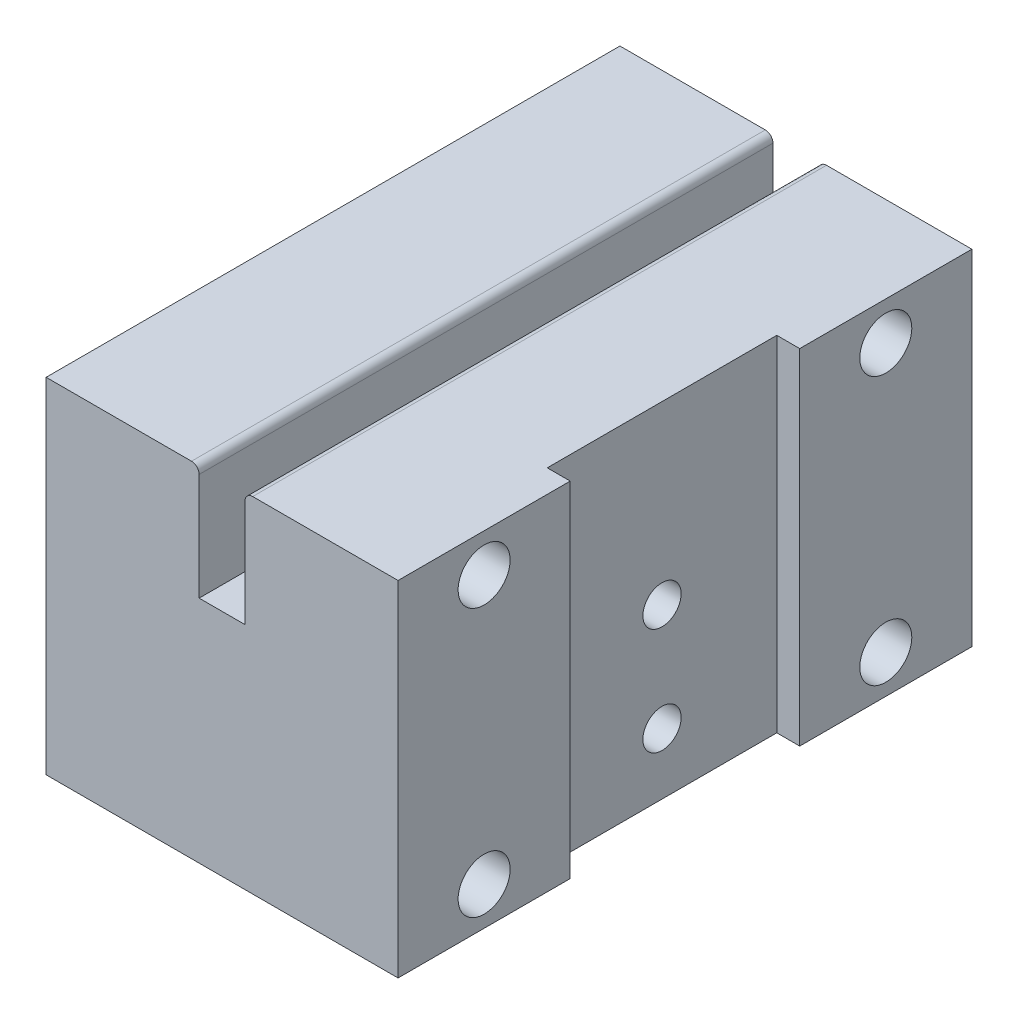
ISO-10303-21;
HEADER;
FILE_DESCRIPTION(('STEP AP214'),'2;1');
FILE_NAME('part.step','',(''),(''),'','','');
FILE_SCHEMA(('AUTOMOTIVE_DESIGN { 1 0 10303 214 1 1 1 1 }'));
ENDSEC;
DATA;
#1=APPLICATION_CONTEXT('core data for automotive mechanical design processes');
#2=APPLICATION_PROTOCOL_DEFINITION('international standard','automotive_design',2000,#1);
#3=PRODUCT_CONTEXT('',#1,'mechanical');
#4=PRODUCT('Part','Part','',(#3));
#5=PRODUCT_RELATED_PRODUCT_CATEGORY('part','',(#4));
#6=PRODUCT_DEFINITION_FORMATION('','',#4);
#7=PRODUCT_DEFINITION_CONTEXT('part definition',#1,'design');
#8=PRODUCT_DEFINITION('design','',#6,#7);
#9=PRODUCT_DEFINITION_SHAPE('','',#8);
#10=(LENGTH_UNIT() NAMED_UNIT(*) SI_UNIT(.MILLI.,.METRE.));
#11=(NAMED_UNIT(*) PLANE_ANGLE_UNIT() SI_UNIT($,.RADIAN.));
#12=(NAMED_UNIT(*) SI_UNIT($,.STERADIAN.) SOLID_ANGLE_UNIT());
#13=UNCERTAINTY_MEASURE_WITH_UNIT(LENGTH_MEASURE(1.E-05),#10,'distance_accuracy_value','');
#14=(GEOMETRIC_REPRESENTATION_CONTEXT(3) GLOBAL_UNCERTAINTY_ASSIGNED_CONTEXT((#13)) GLOBAL_UNIT_ASSIGNED_CONTEXT((#10,
#11,#12)) REPRESENTATION_CONTEXT('',''));
#15=CARTESIAN_POINT('',(0.,0.,0.));
#16=DIRECTION('',(0.,0.,1.));
#17=DIRECTION('',(1.,0.,0.));
#18=AXIS2_PLACEMENT_3D('',#15,#16,#17);
#19=CARTESIAN_POINT('',(23.,22.5,37.5));
#20=DIRECTION('',(-1.,0.,0.));
#21=DIRECTION('',(0.,-1.,0.));
#22=AXIS2_PLACEMENT_3D('',#19,#20,#21);
#23=PLANE('',#22);
#24=CARTESIAN_POINT('',(23.,-17.5,-26.2500000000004));
#25=DIRECTION('',(1.,0.,0.));
#26=DIRECTION('',(0.,1.,0.));
#27=AXIS2_PLACEMENT_3D('',#24,#25,#26);
#28=CIRCLE('',#27,3.4);
#29=CARTESIAN_POINT('',(23.,-14.1,-26.2500000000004));
#30=VERTEX_POINT('',#29);
#31=EDGE_CURVE('E627',#30,#30,#28,.T.);
#32=ORIENTED_EDGE('',*,*,#31,.F.);
#33=EDGE_LOOP('',(#32));
#34=FACE_BOUND('',#33,.T.);
#35=CARTESIAN_POINT('',(23.,17.5,-26.25));
#36=DIRECTION('',(1.,0.,0.));
#37=DIRECTION('',(0.,1.,0.));
#38=AXIS2_PLACEMENT_3D('',#35,#36,#37);
#39=CIRCLE('',#38,3.4);
#40=CARTESIAN_POINT('',(23.,20.9,-26.25));
#41=VERTEX_POINT('',#40);
#42=EDGE_CURVE('E373',#41,#41,#39,.T.);
#43=ORIENTED_EDGE('',*,*,#42,.F.);
#44=EDGE_LOOP('',(#43));
#45=FACE_BOUND('',#44,.T.);
#46=DIRECTION('',(0.,0.,-1.));
#47=VECTOR('',#46,1.);
#48=CARTESIAN_POINT('',(23.,22.5,37.5));
#49=LINE('',#48,#47);
#50=CARTESIAN_POINT('',(23.,22.5,-15.));
#51=VERTEX_POINT('',#50);
#52=CARTESIAN_POINT('',(23.,22.5,-37.5));
#53=VERTEX_POINT('',#52);
#54=EDGE_CURVE('E247',#51,#53,#49,.T.);
#55=ORIENTED_EDGE('',*,*,#54,.F.);
#56=DIRECTION('',(0.,1.,0.));
#57=VECTOR('',#56,1.);
#58=CARTESIAN_POINT('',(23.,22.5,-15.));
#59=LINE('',#58,#57);
#60=CARTESIAN_POINT('',(23.,-22.5,-15.));
#61=VERTEX_POINT('',#60);
#62=EDGE_CURVE('E158',#61,#51,#59,.T.);
#63=ORIENTED_EDGE('',*,*,#62,.F.);
#64=DIRECTION('',(0.,0.,-1.));
#65=VECTOR('',#64,1.);
#66=CARTESIAN_POINT('',(23.,-22.5,37.5));
#67=LINE('',#66,#65);
#68=CARTESIAN_POINT('',(23.,-22.5,-37.5));
#69=VERTEX_POINT('',#68);
#70=EDGE_CURVE('E220',#61,#69,#67,.T.);
#71=ORIENTED_EDGE('',*,*,#70,.T.);
#72=DIRECTION('',(0.,1.,0.));
#73=VECTOR('',#72,1.);
#74=CARTESIAN_POINT('',(23.,22.5,-37.5));
#75=LINE('',#74,#73);
#76=EDGE_CURVE('E203',#69,#53,#75,.T.);
#77=ORIENTED_EDGE('',*,*,#76,.T.);
#78=EDGE_LOOP('',(#55,#63,#71,#77));
#79=FACE_BOUND('',#78,.T.);
#80=ADVANCED_FACE('F39',(#34,#45,#79),#23,.F.);
#81=CARTESIAN_POINT('',(-23.,22.5,37.5));
#82=DIRECTION('',(0.,-1.,0.));
#83=DIRECTION('',(0.,0.,-1.));
#84=AXIS2_PLACEMENT_3D('',#81,#82,#83);
#85=PLANE('',#84);
#86=DIRECTION('',(-1.,0.,0.));
#87=VECTOR('',#86,1.);
#88=CARTESIAN_POINT('',(-23.,22.5,37.5));
#89=LINE('',#88,#87);
#90=CARTESIAN_POINT('',(-4.,22.5,37.5));
#91=VERTEX_POINT('',#90);
#92=CARTESIAN_POINT('',(-23.,22.5,37.5));
#93=VERTEX_POINT('',#92);
#94=EDGE_CURVE('E208',#91,#93,#89,.T.);
#95=ORIENTED_EDGE('',*,*,#94,.F.);
#96=DIRECTION('',(0.,0.,1.));
#97=VECTOR('',#96,1.);
#98=CARTESIAN_POINT('',(-4.,22.5,37.5));
#99=LINE('',#98,#97);
#100=CARTESIAN_POINT('',(-4.,22.5,-37.5));
#101=VERTEX_POINT('',#100);
#102=EDGE_CURVE('E11',#91,#101,#99,.F.);
#103=ORIENTED_EDGE('',*,*,#102,.T.);
#104=DIRECTION('',(-1.,0.,0.));
#105=VECTOR('',#104,1.);
#106=CARTESIAN_POINT('',(-23.,22.5,-37.5));
#107=LINE('',#106,#105);
#108=CARTESIAN_POINT('',(-23.,22.5,-37.5));
#109=VERTEX_POINT('',#108);
#110=EDGE_CURVE('E224',#101,#109,#107,.T.);
#111=ORIENTED_EDGE('',*,*,#110,.T.);
#112=DIRECTION('',(0.,0.,-1.));
#113=VECTOR('',#112,1.);
#114=CARTESIAN_POINT('',(-23.,22.5,37.5));
#115=LINE('',#114,#113);
#116=EDGE_CURVE('E243',#93,#109,#115,.T.);
#117=ORIENTED_EDGE('',*,*,#116,.F.);
#118=EDGE_LOOP('',(#95,#103,#111,#117));
#119=FACE_BOUND('',#118,.T.);
#120=ADVANCED_FACE('F328',(#119),#85,.F.);
#121=CARTESIAN_POINT('',(23.,-17.5,26.2499999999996));
#122=DIRECTION('',(1.,0.,0.));
#123=DIRECTION('',(0.,1.,0.));
#124=AXIS2_PLACEMENT_3D('',#121,#122,#123);
#125=CIRCLE('',#124,3.4);
#126=CARTESIAN_POINT('',(23.,-14.1,26.2499999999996));
#127=VERTEX_POINT('',#126);
#128=EDGE_CURVE('E358',#127,#127,#125,.T.);
#129=ORIENTED_EDGE('',*,*,#128,.F.);
#130=EDGE_LOOP('',(#129));
#131=FACE_BOUND('',#130,.T.);
#132=CARTESIAN_POINT('',(23.,17.5,26.25));
#133=DIRECTION('',(1.,0.,0.));
#134=DIRECTION('',(0.,1.,0.));
#135=AXIS2_PLACEMENT_3D('',#132,#133,#134);
#136=CIRCLE('',#135,3.4);
#137=CARTESIAN_POINT('',(23.,20.9,26.25));
#138=VERTEX_POINT('',#137);
#139=EDGE_CURVE('E361',#138,#138,#136,.T.);
#140=ORIENTED_EDGE('',*,*,#139,.F.);
#141=EDGE_LOOP('',(#140));
#142=FACE_BOUND('',#141,.T.);
#143=CARTESIAN_POINT('',(23.,-22.5,37.5));
#144=VERTEX_POINT('',#143);
#145=CARTESIAN_POINT('',(23.,-22.5,15.));
#146=VERTEX_POINT('',#145);
#147=EDGE_CURVE('E235',#144,#146,#67,.T.);
#148=ORIENTED_EDGE('',*,*,#147,.T.);
#149=DIRECTION('',(0.,-1.,0.));
#150=VECTOR('',#149,1.);
#151=CARTESIAN_POINT('',(23.,22.5,15.));
#152=LINE('',#151,#150);
#153=CARTESIAN_POINT('',(23.,22.5,15.));
#154=VERTEX_POINT('',#153);
#155=EDGE_CURVE('E298',#154,#146,#152,.T.);
#156=ORIENTED_EDGE('',*,*,#155,.F.);
#157=CARTESIAN_POINT('',(23.,22.5,37.5));
#158=VERTEX_POINT('',#157);
#159=EDGE_CURVE('E163',#158,#154,#49,.T.);
#160=ORIENTED_EDGE('',*,*,#159,.F.);
#161=DIRECTION('',(0.,1.,0.));
#162=VECTOR('',#161,1.);
#163=CARTESIAN_POINT('',(23.,22.5,37.5));
#164=LINE('',#163,#162);
#165=EDGE_CURVE('E204',#144,#158,#164,.T.);
#166=ORIENTED_EDGE('',*,*,#165,.F.);
#167=EDGE_LOOP('',(#148,#156,#160,#166));
#168=FACE_BOUND('',#167,.T.);
#169=ADVANCED_FACE('F297',(#131,#142,#168),#23,.F.);
#170=DIRECTION('',(0.,0.,1.));
#171=VECTOR('',#170,1.);
#172=CARTESIAN_POINT('',(20.,22.5,15.));
#173=LINE('',#172,#171);
#174=CARTESIAN_POINT('',(20.,22.5,-15.));
#175=VERTEX_POINT('',#174);
#176=CARTESIAN_POINT('',(20.,22.5,15.));
#177=VERTEX_POINT('',#176);
#178=EDGE_CURVE('E148',#175,#177,#173,.T.);
#179=ORIENTED_EDGE('',*,*,#178,.F.);
#180=DIRECTION('',(1.,0.,0.));
#181=VECTOR('',#180,1.);
#182=CARTESIAN_POINT('',(20.,22.5,-15.));
#183=LINE('',#182,#181);
#184=EDGE_CURVE('E177',#175,#51,#183,.T.);
#185=ORIENTED_EDGE('',*,*,#184,.T.);
#186=ORIENTED_EDGE('',*,*,#54,.T.);
#187=CARTESIAN_POINT('',(4.,22.5,-37.5));
#188=VERTEX_POINT('',#187);
#189=EDGE_CURVE('E225',#53,#188,#107,.T.);
#190=ORIENTED_EDGE('',*,*,#189,.T.);
#191=DIRECTION('',(0.,0.,1.));
#192=VECTOR('',#191,1.);
#193=CARTESIAN_POINT('',(4.,22.5,37.5));
#194=LINE('',#193,#192);
#195=CARTESIAN_POINT('',(4.,22.5,37.5));
#196=VERTEX_POINT('',#195);
#197=EDGE_CURVE('E250',#188,#196,#194,.T.);
#198=ORIENTED_EDGE('',*,*,#197,.T.);
#199=EDGE_CURVE('E210',#158,#196,#89,.T.);
#200=ORIENTED_EDGE('',*,*,#199,.F.);
#201=ORIENTED_EDGE('',*,*,#159,.T.);
#202=DIRECTION('',(1.,0.,0.));
#203=VECTOR('',#202,1.);
#204=CARTESIAN_POINT('',(20.,22.5,15.));
#205=LINE('',#204,#203);
#206=EDGE_CURVE('E141',#177,#154,#205,.T.);
#207=ORIENTED_EDGE('',*,*,#206,.F.);
#208=EDGE_LOOP('',(#179,#185,#186,#190,#198,#200,#201,#207));
#209=FACE_BOUND('',#208,.T.);
#210=ADVANCED_FACE('F161',(#209),#85,.F.);
#211=CARTESIAN_POINT('',(-23.,22.5,37.5));
#212=DIRECTION('',(1.,0.,0.));
#213=DIRECTION('',(0.,1.,0.));
#214=AXIS2_PLACEMENT_3D('',#211,#212,#213);
#215=PLANE('',#214);
#216=DIRECTION('',(0.,-1.,0.));
#217=VECTOR('',#216,1.);
#218=CARTESIAN_POINT('',(-23.,22.5,-37.5));
#219=LINE('',#218,#217);
#220=CARTESIAN_POINT('',(-23.,-22.5,-37.5));
#221=VERTEX_POINT('',#220);
#222=EDGE_CURVE('E229',#109,#221,#219,.T.);
#223=ORIENTED_EDGE('',*,*,#222,.T.);
#224=DIRECTION('',(0.,0.,-1.));
#225=VECTOR('',#224,1.);
#226=CARTESIAN_POINT('',(-23.,-22.5,37.5));
#227=LINE('',#226,#225);
#228=CARTESIAN_POINT('',(-23.,-22.5,37.5));
#229=VERTEX_POINT('',#228);
#230=EDGE_CURVE('E239',#229,#221,#227,.T.);
#231=ORIENTED_EDGE('',*,*,#230,.F.);
#232=DIRECTION('',(0.,-1.,0.));
#233=VECTOR('',#232,1.);
#234=CARTESIAN_POINT('',(-23.,22.5,37.5));
#235=LINE('',#234,#233);
#236=EDGE_CURVE('E214',#93,#229,#235,.T.);
#237=ORIENTED_EDGE('',*,*,#236,.F.);
#238=ORIENTED_EDGE('',*,*,#116,.T.);
#239=EDGE_LOOP('',(#223,#231,#237,#238));
#240=FACE_BOUND('',#239,.T.);
#241=ADVANCED_FACE('F333',(#240),#215,.F.);
#242=CARTESIAN_POINT('',(-23.,-22.5,37.5));
#243=DIRECTION('',(0.,1.,0.));
#244=DIRECTION('',(0.,0.,1.));
#245=AXIS2_PLACEMENT_3D('',#242,#243,#244);
#246=PLANE('',#245);
#247=ORIENTED_EDGE('',*,*,#70,.F.);
#248=DIRECTION('',(1.,0.,0.));
#249=VECTOR('',#248,1.);
#250=CARTESIAN_POINT('',(20.,-22.5,-15.));
#251=LINE('',#250,#249);
#252=CARTESIAN_POINT('',(20.,-22.5,-15.));
#253=VERTEX_POINT('',#252);
#254=EDGE_CURVE('E168',#253,#61,#251,.T.);
#255=ORIENTED_EDGE('',*,*,#254,.F.);
#256=DIRECTION('',(0.,0.,-1.));
#257=VECTOR('',#256,1.);
#258=CARTESIAN_POINT('',(20.,-22.5,15.));
#259=LINE('',#258,#257);
#260=CARTESIAN_POINT('',(20.,-22.5,15.));
#261=VERTEX_POINT('',#260);
#262=EDGE_CURVE('E147',#261,#253,#259,.T.);
#263=ORIENTED_EDGE('',*,*,#262,.F.);
#264=DIRECTION('',(1.,0.,0.));
#265=VECTOR('',#264,1.);
#266=CARTESIAN_POINT('',(20.,-22.5,15.));
#267=LINE('',#266,#265);
#268=EDGE_CURVE('E144',#261,#146,#267,.T.);
#269=ORIENTED_EDGE('',*,*,#268,.T.);
#270=ORIENTED_EDGE('',*,*,#147,.F.);
#271=DIRECTION('',(1.,0.,0.));
#272=VECTOR('',#271,1.);
#273=CARTESIAN_POINT('',(-23.,-22.5,37.5));
#274=LINE('',#273,#272);
#275=EDGE_CURVE('E217',#229,#144,#274,.T.);
#276=ORIENTED_EDGE('',*,*,#275,.F.);
#277=ORIENTED_EDGE('',*,*,#230,.T.);
#278=DIRECTION('',(1.,0.,0.));
#279=VECTOR('',#278,1.);
#280=CARTESIAN_POINT('',(-23.,-22.5,-37.5));
#281=LINE('',#280,#279);
#282=EDGE_CURVE('E209',#221,#69,#281,.T.);
#283=ORIENTED_EDGE('',*,*,#282,.T.);
#284=EDGE_LOOP('',(#247,#255,#263,#269,#270,#276,#277,#283));
#285=FACE_BOUND('',#284,.T.);
#286=ADVANCED_FACE('F320',(#285),#246,.F.);
#287=CARTESIAN_POINT('',(0.,0.,37.5));
#288=DIRECTION('',(0.,0.,1.));
#289=DIRECTION('',(1.,0.,0.));
#290=AXIS2_PLACEMENT_3D('',#287,#288,#289);
#291=PLANE('',#290);
#292=ORIENTED_EDGE('',*,*,#199,.T.);
#293=CARTESIAN_POINT('',(4.,21.5,37.5));
#294=DIRECTION('',(0.,0.,1.));
#295=DIRECTION('',(1.,0.,0.));
#296=AXIS2_PLACEMENT_3D('',#293,#294,#295);
#297=CIRCLE('',#296,1.);
#298=CARTESIAN_POINT('',(3.,21.5,37.5));
#299=VERTEX_POINT('',#298);
#300=EDGE_CURVE('E257',#196,#299,#297,.T.);
#301=ORIENTED_EDGE('',*,*,#300,.T.);
#302=DIRECTION('',(0.,1.,0.));
#303=VECTOR('',#302,1.);
#304=CARTESIAN_POINT('',(3.,0.,37.5));
#305=LINE('',#304,#303);
#306=CARTESIAN_POINT('',(3.,7.5,37.5));
#307=VERTEX_POINT('',#306);
#308=EDGE_CURVE('E196',#307,#299,#305,.T.);
#309=ORIENTED_EDGE('',*,*,#308,.F.);
#310=DIRECTION('',(1.,0.,0.));
#311=VECTOR('',#310,1.);
#312=CARTESIAN_POINT('',(0.,7.5,37.5));
#313=LINE('',#312,#311);
#314=CARTESIAN_POINT('',(-3.,7.5,37.5));
#315=VERTEX_POINT('',#314);
#316=EDGE_CURVE('E190',#315,#307,#313,.T.);
#317=ORIENTED_EDGE('',*,*,#316,.F.);
#318=DIRECTION('',(0.,-1.,0.));
#319=VECTOR('',#318,1.);
#320=CARTESIAN_POINT('',(-3.,0.,37.5));
#321=LINE('',#320,#319);
#322=CARTESIAN_POINT('',(-3.,21.5,37.5));
#323=VERTEX_POINT('',#322);
#324=EDGE_CURVE('E200',#323,#315,#321,.T.);
#325=ORIENTED_EDGE('',*,*,#324,.F.);
#326=CARTESIAN_POINT('',(-4.,21.5,37.5));
#327=DIRECTION('',(0.,0.,1.));
#328=DIRECTION('',(1.,0.,0.));
#329=AXIS2_PLACEMENT_3D('',#326,#327,#328);
#330=CIRCLE('',#329,1.);
#331=EDGE_CURVE('E254',#323,#91,#330,.T.);
#332=ORIENTED_EDGE('',*,*,#331,.T.);
#333=ORIENTED_EDGE('',*,*,#94,.T.);
#334=ORIENTED_EDGE('',*,*,#236,.T.);
#335=ORIENTED_EDGE('',*,*,#275,.T.);
#336=ORIENTED_EDGE('',*,*,#165,.T.);
#337=EDGE_LOOP('',(#292,#301,#309,#317,#325,#332,#333,#334,#335,#336));
#338=FACE_BOUND('',#337,.T.);
#339=ADVANCED_FACE('F277',(#338),#291,.T.);
#340=CARTESIAN_POINT('',(0.,0.,-37.5));
#341=DIRECTION('',(0.,0.,1.));
#342=DIRECTION('',(1.,0.,0.));
#343=AXIS2_PLACEMENT_3D('',#340,#341,#342);
#344=PLANE('',#343);
#345=DIRECTION('',(0.,1.,0.));
#346=VECTOR('',#345,1.);
#347=CARTESIAN_POINT('',(3.,22.5,-37.5));
#348=LINE('',#347,#346);
#349=CARTESIAN_POINT('',(3.,7.5,-37.5));
#350=VERTEX_POINT('',#349);
#351=CARTESIAN_POINT('',(3.,21.5,-37.5));
#352=VERTEX_POINT('',#351);
#353=EDGE_CURVE('E181',#350,#352,#348,.T.);
#354=ORIENTED_EDGE('',*,*,#353,.T.);
#355=CARTESIAN_POINT('',(4.,21.5,-37.5));
#356=DIRECTION('',(0.,0.,1.));
#357=DIRECTION('',(1.,0.,0.));
#358=AXIS2_PLACEMENT_3D('',#355,#356,#357);
#359=CIRCLE('',#358,1.);
#360=EDGE_CURVE('E265',#352,#188,#359,.F.);
#361=ORIENTED_EDGE('',*,*,#360,.T.);
#362=ORIENTED_EDGE('',*,*,#189,.F.);
#363=ORIENTED_EDGE('',*,*,#76,.F.);
#364=ORIENTED_EDGE('',*,*,#282,.F.);
#365=ORIENTED_EDGE('',*,*,#222,.F.);
#366=ORIENTED_EDGE('',*,*,#110,.F.);
#367=CARTESIAN_POINT('',(-4.,21.5,-37.5));
#368=DIRECTION('',(0.,0.,1.));
#369=DIRECTION('',(1.,0.,0.));
#370=AXIS2_PLACEMENT_3D('',#367,#368,#369);
#371=CIRCLE('',#370,1.);
#372=CARTESIAN_POINT('',(-3.,21.5,-37.5));
#373=VERTEX_POINT('',#372);
#374=EDGE_CURVE('E63',#101,#373,#371,.F.);
#375=ORIENTED_EDGE('',*,*,#374,.T.);
#376=DIRECTION('',(0.,-1.,0.));
#377=VECTOR('',#376,1.);
#378=CARTESIAN_POINT('',(-3.,22.5,-37.5));
#379=LINE('',#378,#377);
#380=CARTESIAN_POINT('',(-3.,7.5,-37.5));
#381=VERTEX_POINT('',#380);
#382=EDGE_CURVE('E173',#373,#381,#379,.T.);
#383=ORIENTED_EDGE('',*,*,#382,.T.);
#384=DIRECTION('',(1.,0.,0.));
#385=VECTOR('',#384,1.);
#386=CARTESIAN_POINT('',(-3.,7.5,-37.5));
#387=LINE('',#386,#385);
#388=EDGE_CURVE('E176',#381,#350,#387,.T.);
#389=ORIENTED_EDGE('',*,*,#388,.T.);
#390=EDGE_LOOP('',(#354,#361,#362,#363,#364,#365,#366,#375,#383,#389));
#391=FACE_BOUND('',#390,.T.);
#392=ADVANCED_FACE('F288',(#391),#344,.F.);
#393=CARTESIAN_POINT('',(-3.,22.5,-37.5));
#394=DIRECTION('',(-1.,0.,0.));
#395=DIRECTION('',(0.,-1.,0.));
#396=AXIS2_PLACEMENT_3D('',#393,#394,#395);
#397=PLANE('',#396);
#398=ORIENTED_EDGE('',*,*,#382,.F.);
#399=DIRECTION('',(0.,0.,1.));
#400=VECTOR('',#399,1.);
#401=CARTESIAN_POINT('',(-3.,21.5,-37.5));
#402=LINE('',#401,#400);
#403=EDGE_CURVE('E48',#373,#323,#402,.T.);
#404=ORIENTED_EDGE('',*,*,#403,.T.);
#405=ORIENTED_EDGE('',*,*,#324,.T.);
#406=DIRECTION('',(0.,0.,1.));
#407=VECTOR('',#406,1.);
#408=CARTESIAN_POINT('',(-3.,7.5,-37.5));
#409=LINE('',#408,#407);
#410=EDGE_CURVE('E185',#381,#315,#409,.T.);
#411=ORIENTED_EDGE('',*,*,#410,.F.);
#412=EDGE_LOOP('',(#398,#404,#405,#411));
#413=FACE_BOUND('',#412,.T.);
#414=ADVANCED_FACE('F272',(#413),#397,.F.);
#415=CARTESIAN_POINT('',(3.,22.5,-37.5));
#416=DIRECTION('',(1.,0.,0.));
#417=DIRECTION('',(0.,1.,0.));
#418=AXIS2_PLACEMENT_3D('',#415,#416,#417);
#419=PLANE('',#418);
#420=ORIENTED_EDGE('',*,*,#308,.T.);
#421=DIRECTION('',(0.,0.,1.));
#422=VECTOR('',#421,1.);
#423=CARTESIAN_POINT('',(3.,21.5,-37.5));
#424=LINE('',#423,#422);
#425=EDGE_CURVE('E260',#299,#352,#424,.F.);
#426=ORIENTED_EDGE('',*,*,#425,.T.);
#427=ORIENTED_EDGE('',*,*,#353,.F.);
#428=DIRECTION('',(0.,0.,1.));
#429=VECTOR('',#428,1.);
#430=CARTESIAN_POINT('',(3.,7.5,-37.5));
#431=LINE('',#430,#429);
#432=EDGE_CURVE('E186',#350,#307,#431,.T.);
#433=ORIENTED_EDGE('',*,*,#432,.T.);
#434=EDGE_LOOP('',(#420,#426,#427,#433));
#435=FACE_BOUND('',#434,.T.);
#436=ADVANCED_FACE('F285',(#435),#419,.F.);
#437=CARTESIAN_POINT('',(-3.,7.5,-37.5));
#438=DIRECTION('',(0.,-1.,0.));
#439=DIRECTION('',(0.,0.,-1.));
#440=AXIS2_PLACEMENT_3D('',#437,#438,#439);
#441=PLANE('',#440);
#442=ORIENTED_EDGE('',*,*,#316,.T.);
#443=ORIENTED_EDGE('',*,*,#432,.F.);
#444=ORIENTED_EDGE('',*,*,#388,.F.);
#445=ORIENTED_EDGE('',*,*,#410,.T.);
#446=EDGE_LOOP('',(#442,#443,#444,#445));
#447=FACE_BOUND('',#446,.T.);
#448=ADVANCED_FACE('F282',(#447),#441,.F.);
#449=CARTESIAN_POINT('',(4.,21.5,37.5));
#450=DIRECTION('',(0.,0.,1.));
#451=DIRECTION('',(1.,0.,0.));
#452=AXIS2_PLACEMENT_3D('',#449,#450,#451);
#453=CYLINDRICAL_SURFACE('',#452,1.);
#454=ORIENTED_EDGE('',*,*,#360,.F.);
#455=ORIENTED_EDGE('',*,*,#425,.F.);
#456=ORIENTED_EDGE('',*,*,#300,.F.);
#457=ORIENTED_EDGE('',*,*,#197,.F.);
#458=EDGE_LOOP('',(#454,#455,#456,#457));
#459=FACE_BOUND('',#458,.T.);
#460=ADVANCED_FACE('F292',(#459),#453,.T.);
#461=CARTESIAN_POINT('',(-4.,21.5,-37.5));
#462=DIRECTION('',(0.,0.,1.));
#463=DIRECTION('',(1.,0.,0.));
#464=AXIS2_PLACEMENT_3D('',#461,#462,#463);
#465=CYLINDRICAL_SURFACE('',#464,1.);
#466=ORIENTED_EDGE('',*,*,#374,.F.);
#467=ORIENTED_EDGE('',*,*,#102,.F.);
#468=ORIENTED_EDGE('',*,*,#331,.F.);
#469=ORIENTED_EDGE('',*,*,#403,.F.);
#470=EDGE_LOOP('',(#466,#467,#468,#469));
#471=FACE_BOUND('',#470,.T.);
#472=ADVANCED_FACE('F41',(#471),#465,.T.);
#473=CARTESIAN_POINT('',(20.,22.5,-15.));
#474=DIRECTION('',(0.,0.,-1.));
#475=DIRECTION('',(0.,1.,0.));
#476=AXIS2_PLACEMENT_3D('',#473,#474,#475);
#477=PLANE('',#476);
#478=ORIENTED_EDGE('',*,*,#62,.T.);
#479=ORIENTED_EDGE('',*,*,#184,.F.);
#480=DIRECTION('',(0.,1.,0.));
#481=VECTOR('',#480,1.);
#482=CARTESIAN_POINT('',(20.,22.5,-15.));
#483=LINE('',#482,#481);
#484=EDGE_CURVE('E154',#253,#175,#483,.T.);
#485=ORIENTED_EDGE('',*,*,#484,.F.);
#486=ORIENTED_EDGE('',*,*,#254,.T.);
#487=EDGE_LOOP('',(#478,#479,#485,#486));
#488=FACE_BOUND('',#487,.T.);
#489=ADVANCED_FACE('F315',(#488),#477,.F.);
#490=CARTESIAN_POINT('',(20.,22.5,15.));
#491=DIRECTION('',(0.,0.,1.));
#492=DIRECTION('',(0.,-1.,0.));
#493=AXIS2_PLACEMENT_3D('',#490,#491,#492);
#494=PLANE('',#493);
#495=ORIENTED_EDGE('',*,*,#155,.T.);
#496=ORIENTED_EDGE('',*,*,#268,.F.);
#497=DIRECTION('',(0.,-1.,0.));
#498=VECTOR('',#497,1.);
#499=CARTESIAN_POINT('',(20.,22.5,15.));
#500=LINE('',#499,#498);
#501=EDGE_CURVE('E55',#177,#261,#500,.T.);
#502=ORIENTED_EDGE('',*,*,#501,.F.);
#503=ORIENTED_EDGE('',*,*,#206,.T.);
#504=EDGE_LOOP('',(#495,#496,#502,#503));
#505=FACE_BOUND('',#504,.T.);
#506=ADVANCED_FACE('F139',(#505),#494,.F.);
#507=CARTESIAN_POINT('',(20.,0.,0.));
#508=DIRECTION('',(-1.,0.,0.));
#509=DIRECTION('',(0.,-1.,0.));
#510=AXIS2_PLACEMENT_3D('',#507,#508,#509);
#511=PLANE('',#510);
#512=CARTESIAN_POINT('',(20.,-0.499999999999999,0.));
#513=DIRECTION('',(1.,0.,0.));
#514=DIRECTION('',(0.,1.,0.));
#515=AXIS2_PLACEMENT_3D('',#512,#513,#514);
#516=CIRCLE('',#515,2.5);
#517=CARTESIAN_POINT('',(20.,2.,0.));
#518=VERTEX_POINT('',#517);
#519=EDGE_CURVE('E306',#518,#518,#516,.T.);
#520=ORIENTED_EDGE('',*,*,#519,.F.);
#521=EDGE_LOOP('',(#520));
#522=FACE_BOUND('',#521,.T.);
#523=CARTESIAN_POINT('',(20.,-14.5,0.));
#524=DIRECTION('',(1.,0.,0.));
#525=DIRECTION('',(0.,1.,0.));
#526=AXIS2_PLACEMENT_3D('',#523,#524,#525);
#527=CIRCLE('',#526,2.5);
#528=CARTESIAN_POINT('',(20.,-12.,0.));
#529=VERTEX_POINT('',#528);
#530=EDGE_CURVE('E370',#529,#529,#527,.T.);
#531=ORIENTED_EDGE('',*,*,#530,.F.);
#532=EDGE_LOOP('',(#531));
#533=FACE_BOUND('',#532,.T.);
#534=ORIENTED_EDGE('',*,*,#178,.T.);
#535=ORIENTED_EDGE('',*,*,#501,.T.);
#536=ORIENTED_EDGE('',*,*,#262,.T.);
#537=ORIENTED_EDGE('',*,*,#484,.T.);
#538=EDGE_LOOP('',(#534,#535,#536,#537));
#539=FACE_BOUND('',#538,.T.);
#540=ADVANCED_FACE('F152',(#522,#533,#539),#511,.F.);
#541=CARTESIAN_POINT('',(0.,-14.5,0.));
#542=DIRECTION('',(1.,0.,0.));
#543=DIRECTION('',(0.,1.,0.));
#544=AXIS2_PLACEMENT_3D('',#541,#542,#543);
#545=CYLINDRICAL_SURFACE('',#544,2.5);
#546=CARTESIAN_POINT('',(0.,-14.5,0.));
#547=DIRECTION('',(1.,0.,0.));
#548=DIRECTION('',(0.,1.,0.));
#549=AXIS2_PLACEMENT_3D('',#546,#547,#548);
#550=CIRCLE('',#549,2.5);
#551=CARTESIAN_POINT('',(0.,-12.,0.));
#552=VERTEX_POINT('',#551);
#553=EDGE_CURVE('E380',#552,#552,#550,.T.);
#554=ORIENTED_EDGE('',*,*,#553,.F.);
#555=EDGE_LOOP('',(#554));
#556=FACE_BOUND('',#555,.T.);
#557=ORIENTED_EDGE('',*,*,#530,.T.);
#558=EDGE_LOOP('',(#557));
#559=FACE_BOUND('',#558,.T.);
#560=ADVANCED_FACE('F389',(#556,#559),#545,.F.);
#561=CARTESIAN_POINT('',(0.,-14.5,0.));
#562=DIRECTION('',(1.,0.,0.));
#563=DIRECTION('',(0.,1.,0.));
#564=AXIS2_PLACEMENT_3D('',#561,#562,#563);
#565=PLANE('',#564);
#566=ORIENTED_EDGE('',*,*,#553,.T.);
#567=EDGE_LOOP('',(#566));
#568=FACE_BOUND('',#567,.T.);
#569=ADVANCED_FACE('F398',(#568),#565,.T.);
#570=CARTESIAN_POINT('',(0.,-0.500000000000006,0.));
#571=DIRECTION('',(1.,0.,0.));
#572=DIRECTION('',(0.,1.,0.));
#573=AXIS2_PLACEMENT_3D('',#570,#571,#572);
#574=CYLINDRICAL_SURFACE('',#573,2.5);
#575=CARTESIAN_POINT('',(0.,-0.500000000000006,0.));
#576=DIRECTION('',(1.,0.,0.));
#577=DIRECTION('',(0.,1.,0.));
#578=AXIS2_PLACEMENT_3D('',#575,#576,#577);
#579=CIRCLE('',#578,2.5);
#580=CARTESIAN_POINT('',(0.,1.99999999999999,0.));
#581=VERTEX_POINT('',#580);
#582=EDGE_CURVE('E300',#581,#581,#579,.T.);
#583=ORIENTED_EDGE('',*,*,#582,.F.);
#584=EDGE_LOOP('',(#583));
#585=FACE_BOUND('',#584,.T.);
#586=ORIENTED_EDGE('',*,*,#519,.T.);
#587=EDGE_LOOP('',(#586));
#588=FACE_BOUND('',#587,.T.);
#589=ADVANCED_FACE('F576',(#585,#588),#574,.F.);
#590=CARTESIAN_POINT('',(0.,-0.500000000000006,0.));
#591=DIRECTION('',(1.,0.,0.));
#592=DIRECTION('',(0.,1.,0.));
#593=AXIS2_PLACEMENT_3D('',#590,#591,#592);
#594=PLANE('',#593);
#595=ORIENTED_EDGE('',*,*,#582,.T.);
#596=EDGE_LOOP('',(#595));
#597=FACE_BOUND('',#596,.T.);
#598=ADVANCED_FACE('F497',(#597),#594,.T.);
#599=CARTESIAN_POINT('',(8.,17.5,26.25));
#600=DIRECTION('',(1.,0.,0.));
#601=DIRECTION('',(0.,1.,0.));
#602=AXIS2_PLACEMENT_3D('',#599,#600,#601);
#603=CYLINDRICAL_SURFACE('',#602,3.4);
#604=CARTESIAN_POINT('',(8.,17.5,26.25));
#605=DIRECTION('',(1.,0.,0.));
#606=DIRECTION('',(0.,1.,0.));
#607=AXIS2_PLACEMENT_3D('',#604,#605,#606);
#608=CIRCLE('',#607,3.4);
#609=CARTESIAN_POINT('',(8.,20.9,26.25));
#610=VERTEX_POINT('',#609);
#611=EDGE_CURVE('E364',#610,#610,#608,.T.);
#612=ORIENTED_EDGE('',*,*,#611,.F.);
#613=EDGE_LOOP('',(#612));
#614=FACE_BOUND('',#613,.T.);
#615=ORIENTED_EDGE('',*,*,#139,.T.);
#616=EDGE_LOOP('',(#615));
#617=FACE_BOUND('',#616,.T.);
#618=ADVANCED_FACE('F491',(#614,#617),#603,.F.);
#619=CARTESIAN_POINT('',(8.,17.5,26.25));
#620=DIRECTION('',(1.,0.,0.));
#621=DIRECTION('',(0.,1.,0.));
#622=AXIS2_PLACEMENT_3D('',#619,#620,#621);
#623=PLANE('',#622);
#624=ORIENTED_EDGE('',*,*,#611,.T.);
#625=EDGE_LOOP('',(#624));
#626=FACE_BOUND('',#625,.T.);
#627=ADVANCED_FACE('F496',(#626),#623,.T.);
#628=CARTESIAN_POINT('',(8.,-17.5,26.2499999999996));
#629=DIRECTION('',(1.,0.,0.));
#630=DIRECTION('',(0.,1.,0.));
#631=AXIS2_PLACEMENT_3D('',#628,#629,#630);
#632=CYLINDRICAL_SURFACE('',#631,3.4);
#633=CARTESIAN_POINT('',(8.,-17.5,26.2499999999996));
#634=DIRECTION('',(1.,0.,0.));
#635=DIRECTION('',(0.,1.,0.));
#636=AXIS2_PLACEMENT_3D('',#633,#634,#635);
#637=CIRCLE('',#636,3.4);
#638=CARTESIAN_POINT('',(8.,-14.1,26.2499999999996));
#639=VERTEX_POINT('',#638);
#640=EDGE_CURVE('E634',#639,#639,#637,.T.);
#641=ORIENTED_EDGE('',*,*,#640,.F.);
#642=EDGE_LOOP('',(#641));
#643=FACE_BOUND('',#642,.T.);
#644=ORIENTED_EDGE('',*,*,#128,.T.);
#645=EDGE_LOOP('',(#644));
#646=FACE_BOUND('',#645,.T.);
#647=ADVANCED_FACE('F509',(#643,#646),#632,.F.);
#648=CARTESIAN_POINT('',(8.,-17.5,26.2499999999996));
#649=DIRECTION('',(1.,0.,0.));
#650=DIRECTION('',(0.,1.,0.));
#651=AXIS2_PLACEMENT_3D('',#648,#649,#650);
#652=PLANE('',#651);
#653=ORIENTED_EDGE('',*,*,#640,.T.);
#654=EDGE_LOOP('',(#653));
#655=FACE_BOUND('',#654,.T.);
#656=ADVANCED_FACE('F519',(#655),#652,.T.);
#657=CARTESIAN_POINT('',(8.,17.5,-26.25));
#658=DIRECTION('',(1.,0.,0.));
#659=DIRECTION('',(0.,1.,0.));
#660=AXIS2_PLACEMENT_3D('',#657,#658,#659);
#661=CYLINDRICAL_SURFACE('',#660,3.4);
#662=CARTESIAN_POINT('',(8.,17.5,-26.25));
#663=DIRECTION('',(1.,0.,0.));
#664=DIRECTION('',(0.,1.,0.));
#665=AXIS2_PLACEMENT_3D('',#662,#663,#664);
#666=CIRCLE('',#665,3.4);
#667=CARTESIAN_POINT('',(8.,20.9,-26.25));
#668=VERTEX_POINT('',#667);
#669=EDGE_CURVE('E365',#668,#668,#666,.T.);
#670=ORIENTED_EDGE('',*,*,#669,.F.);
#671=EDGE_LOOP('',(#670));
#672=FACE_BOUND('',#671,.T.);
#673=ORIENTED_EDGE('',*,*,#42,.T.);
#674=EDGE_LOOP('',(#673));
#675=FACE_BOUND('',#674,.T.);
#676=ADVANCED_FACE('F529',(#672,#675),#661,.F.);
#677=CARTESIAN_POINT('',(8.,17.5,-26.25));
#678=DIRECTION('',(1.,0.,0.));
#679=DIRECTION('',(0.,1.,0.));
#680=AXIS2_PLACEMENT_3D('',#677,#678,#679);
#681=PLANE('',#680);
#682=ORIENTED_EDGE('',*,*,#669,.T.);
#683=EDGE_LOOP('',(#682));
#684=FACE_BOUND('',#683,.T.);
#685=ADVANCED_FACE('F539',(#684),#681,.T.);
#686=CARTESIAN_POINT('',(8.,-17.5,-26.2500000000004));
#687=DIRECTION('',(1.,0.,0.));
#688=DIRECTION('',(0.,1.,0.));
#689=AXIS2_PLACEMENT_3D('',#686,#687,#688);
#690=CYLINDRICAL_SURFACE('',#689,3.4);
#691=CARTESIAN_POINT('',(8.,-17.5,-26.2500000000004));
#692=DIRECTION('',(1.,0.,0.));
#693=DIRECTION('',(0.,1.,0.));
#694=AXIS2_PLACEMENT_3D('',#691,#692,#693);
#695=CIRCLE('',#694,3.4);
#696=CARTESIAN_POINT('',(8.,-14.1,-26.2500000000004));
#697=VERTEX_POINT('',#696);
#698=EDGE_CURVE('E625',#697,#697,#695,.T.);
#699=ORIENTED_EDGE('',*,*,#698,.F.);
#700=EDGE_LOOP('',(#699));
#701=FACE_BOUND('',#700,.T.);
#702=ORIENTED_EDGE('',*,*,#31,.T.);
#703=EDGE_LOOP('',(#702));
#704=FACE_BOUND('',#703,.T.);
#705=ADVANCED_FACE('F549',(#701,#704),#690,.F.);
#706=CARTESIAN_POINT('',(8.,-17.5,-26.2500000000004));
#707=DIRECTION('',(1.,0.,0.));
#708=DIRECTION('',(0.,1.,0.));
#709=AXIS2_PLACEMENT_3D('',#706,#707,#708);
#710=PLANE('',#709);
#711=ORIENTED_EDGE('',*,*,#698,.T.);
#712=EDGE_LOOP('',(#711));
#713=FACE_BOUND('',#712,.T.);
#714=ADVANCED_FACE('F559',(#713),#710,.T.);
#715=CLOSED_SHELL('',(#80,#120,#169,#210,#241,#286,#339,#392,#414,#436,#448,#460,#472,#489,#506,
#540,#560,#569,#589,#598,#618,#627,#647,#656,#676,#685,#705,#714));
#716=MANIFOLD_SOLID_BREP('B2',#715);
#717=ADVANCED_BREP_SHAPE_REPRESENTATION('',(#18,#716),#14);
#718=SHAPE_DEFINITION_REPRESENTATION(#9,#717);
ENDSEC;
END-ISO-10303-21;
